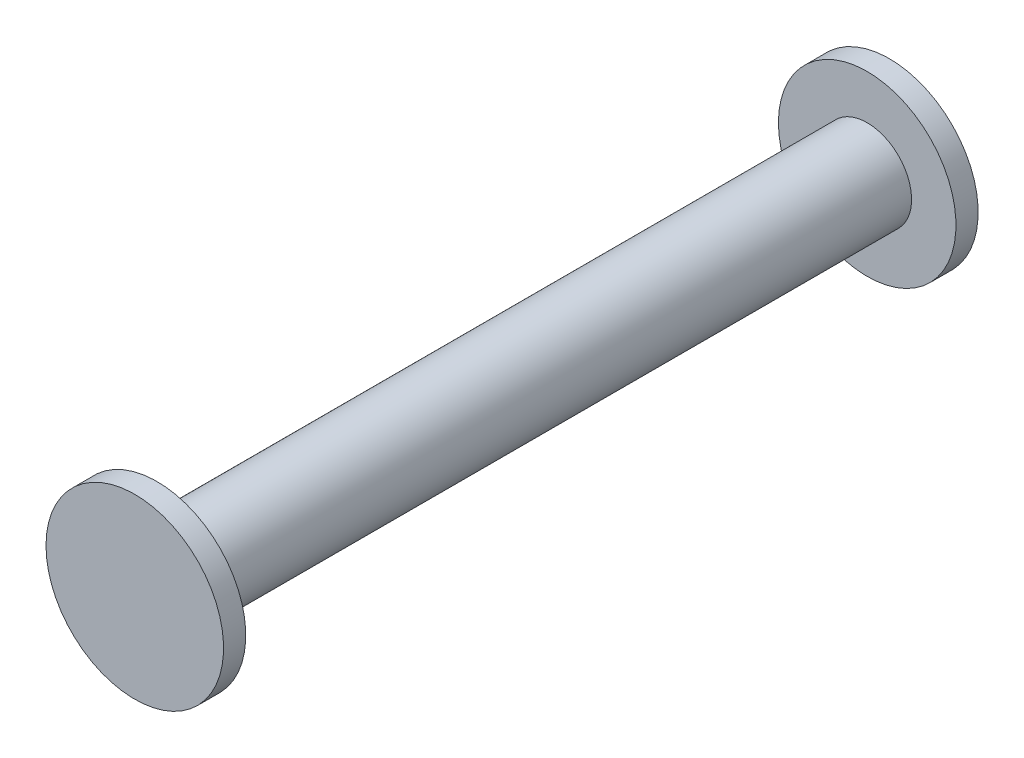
from build123d import *


with BuildPart() as part:
    # Esquisse1 → R_volution1 (revolve)
    with BuildSketch(Plane(origin=(0, 0, 0), x_dir=(1, 0, 0), z_dir=(0, 1, 0)), mode=Mode.PRIVATE) as r_volution1_sk:
        Polygon((0, 17), (2, 17), (2, 16.5), (1, 16.5), (1, 0.5), (2, 0.5), (2, 0), (0, 0), align=None)
    revolve(r_volution1_sk.sketch.rotate(Axis((0, 0, -31.36470245), (0, 0, 1)), 180), axis=Axis((0, 0, -31.36470245), (0, 0, 1)))


solid = part.part
